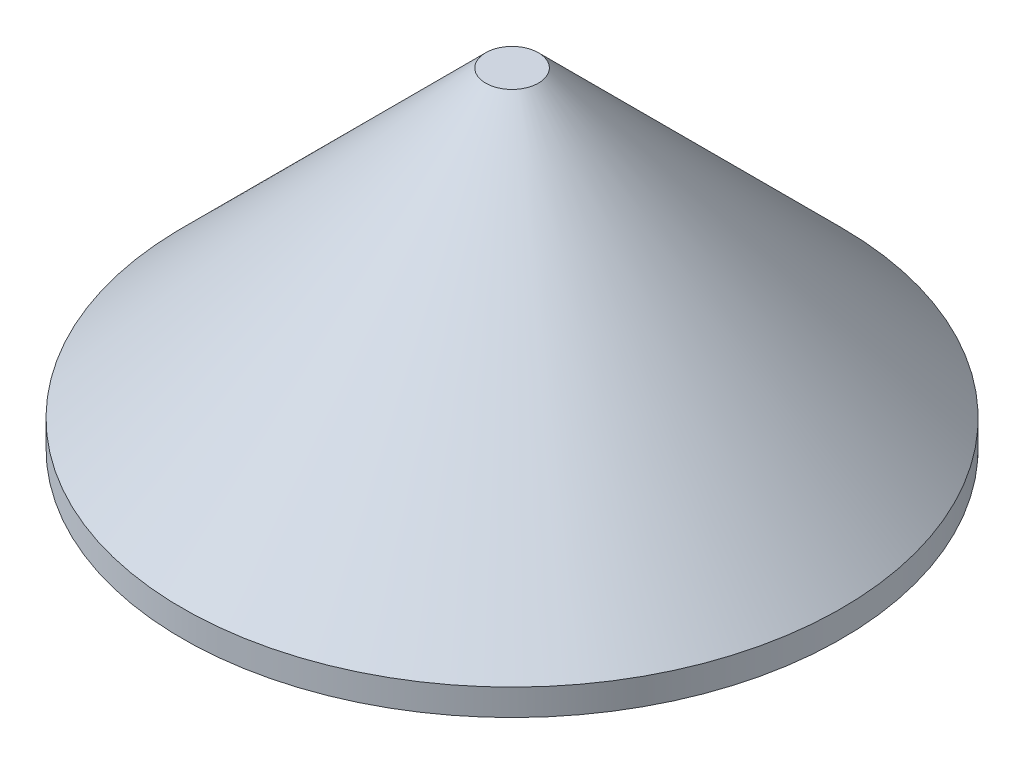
from build123d import *


with BuildPart() as part:
    # Skizze1 → Rotation1 (revolve)
    with BuildSketch(Plane.XY, mode=Mode.PRIVATE) as rotation1_sk:
        Polygon((0, 0), (25, 0), (25, 2), (2, 25), (0, 25), align=None)
    revolve(rotation1_sk.sketch.rotate(Axis((0, 0, 0), (0, 1, 0)), 90), axis=Axis((0, 0, 0), (0, 1, 0)))


solid = part.part
